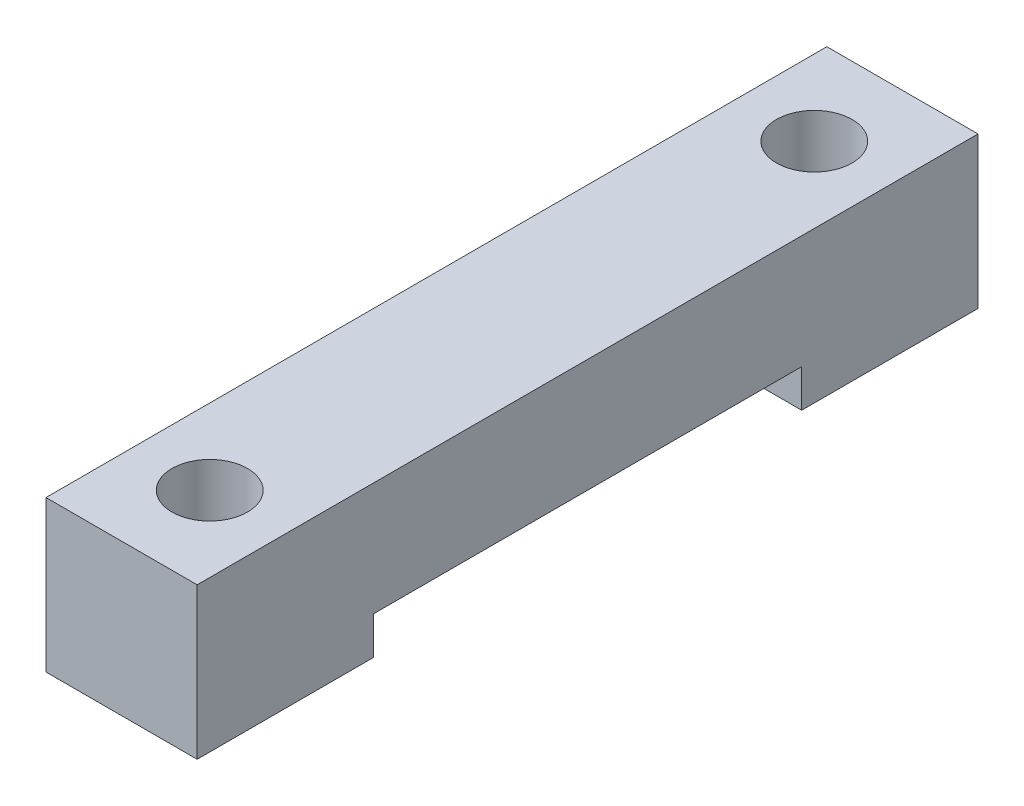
ISO-10303-21;
HEADER;
FILE_DESCRIPTION(('STEP AP214'),'2;1');
FILE_NAME('part.step','',(''),(''),'','','');
FILE_SCHEMA(('AUTOMOTIVE_DESIGN { 1 0 10303 214 1 1 1 1 }'));
ENDSEC;
DATA;
#1=APPLICATION_CONTEXT('core data for automotive mechanical design processes');
#2=APPLICATION_PROTOCOL_DEFINITION('international standard','automotive_design',2000,#1);
#3=PRODUCT_CONTEXT('',#1,'mechanical');
#4=PRODUCT('Part','Part','',(#3));
#5=PRODUCT_RELATED_PRODUCT_CATEGORY('part','',(#4));
#6=PRODUCT_DEFINITION_FORMATION('','',#4);
#7=PRODUCT_DEFINITION_CONTEXT('part definition',#1,'design');
#8=PRODUCT_DEFINITION('design','',#6,#7);
#9=PRODUCT_DEFINITION_SHAPE('','',#8);
#10=(LENGTH_UNIT() NAMED_UNIT(*) SI_UNIT(.MILLI.,.METRE.));
#11=(NAMED_UNIT(*) PLANE_ANGLE_UNIT() SI_UNIT($,.RADIAN.));
#12=(NAMED_UNIT(*) SI_UNIT($,.STERADIAN.) SOLID_ANGLE_UNIT());
#13=UNCERTAINTY_MEASURE_WITH_UNIT(LENGTH_MEASURE(1.E-05),#10,'distance_accuracy_value','');
#14=(GEOMETRIC_REPRESENTATION_CONTEXT(3) GLOBAL_UNCERTAINTY_ASSIGNED_CONTEXT((#13)) GLOBAL_UNIT_ASSIGNED_CONTEXT((#10,
#11,#12)) REPRESENTATION_CONTEXT('',''));
#15=CARTESIAN_POINT('',(0.,0.,0.));
#16=DIRECTION('',(0.,0.,1.));
#17=DIRECTION('',(1.,0.,0.));
#18=AXIS2_PLACEMENT_3D('',#15,#16,#17);
#19=CARTESIAN_POINT('',(0.,0.,-62.));
#20=DIRECTION('',(0.,-1.,0.));
#21=DIRECTION('',(0.,0.,-1.));
#22=AXIS2_PLACEMENT_3D('',#19,#20,#21);
#23=PLANE('',#22);
#24=DIRECTION('',(1.,0.,0.));
#25=VECTOR('',#24,1.);
#26=CARTESIAN_POINT('',(0.,0.,-14.));
#27=LINE('',#26,#25);
#28=CARTESIAN_POINT('',(0.,0.,-14.));
#29=VERTEX_POINT('',#28);
#30=CARTESIAN_POINT('',(12.,0.,-14.));
#31=VERTEX_POINT('',#30);
#32=EDGE_CURVE('E106',#29,#31,#27,.T.);
#33=ORIENTED_EDGE('',*,*,#32,.T.);
#34=DIRECTION('',(0.,0.,-1.));
#35=VECTOR('',#34,1.);
#36=CARTESIAN_POINT('',(12.,0.,0.));
#37=LINE('',#36,#35);
#38=CARTESIAN_POINT('',(12.,0.,0.));
#39=VERTEX_POINT('',#38);
#40=EDGE_CURVE('E142',#39,#31,#37,.T.);
#41=ORIENTED_EDGE('',*,*,#40,.F.);
#42=DIRECTION('',(1.,0.,0.));
#43=VECTOR('',#42,1.);
#44=CARTESIAN_POINT('',(0.,0.,0.));
#45=LINE('',#44,#43);
#46=CARTESIAN_POINT('',(0.,0.,0.));
#47=VERTEX_POINT('',#46);
#48=EDGE_CURVE('E129',#47,#39,#45,.T.);
#49=ORIENTED_EDGE('',*,*,#48,.F.);
#50=DIRECTION('',(0.,0.,1.));
#51=VECTOR('',#50,1.);
#52=CARTESIAN_POINT('',(0.,0.,0.));
#53=LINE('',#52,#51);
#54=EDGE_CURVE('E121',#29,#47,#53,.T.);
#55=ORIENTED_EDGE('',*,*,#54,.F.);
#56=EDGE_LOOP('',(#33,#41,#49,#55));
#57=FACE_BOUND('',#56,.T.);
#58=CARTESIAN_POINT('',(6.00000000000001,0.,-7.));
#59=DIRECTION('',(0.,1.,0.));
#60=DIRECTION('',(0.,0.,1.));
#61=AXIS2_PLACEMENT_3D('',#58,#59,#60);
#62=CIRCLE('',#61,3.);
#63=CARTESIAN_POINT('',(6.00000000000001,0.,-4.));
#64=VERTEX_POINT('',#63);
#65=EDGE_CURVE('E195',#64,#64,#62,.T.);
#66=ORIENTED_EDGE('',*,*,#65,.T.);
#67=EDGE_LOOP('',(#66));
#68=FACE_BOUND('',#67,.T.);
#69=ADVANCED_FACE('F31',(#57,#68),#23,.T.);
#70=CARTESIAN_POINT('',(0.,12.,-62.));
#71=DIRECTION('',(0.,-1.,0.));
#72=DIRECTION('',(0.,0.,-1.));
#73=AXIS2_PLACEMENT_3D('',#70,#71,#72);
#74=PLANE('',#73);
#75=CARTESIAN_POINT('',(6.,12.,-55.));
#76=DIRECTION('',(0.,1.,0.));
#77=DIRECTION('',(0.,0.,1.));
#78=AXIS2_PLACEMENT_3D('',#75,#76,#77);
#79=CIRCLE('',#78,3.);
#80=CARTESIAN_POINT('',(6.,12.,-52.));
#81=VERTEX_POINT('',#80);
#82=EDGE_CURVE('E131',#81,#81,#79,.T.);
#83=ORIENTED_EDGE('',*,*,#82,.F.);
#84=EDGE_LOOP('',(#83));
#85=FACE_BOUND('',#84,.T.);
#86=DIRECTION('',(0.,0.,1.));
#87=VECTOR('',#86,1.);
#88=CARTESIAN_POINT('',(0.,12.,0.));
#89=LINE('',#88,#87);
#90=CARTESIAN_POINT('',(0.,12.,-62.));
#91=VERTEX_POINT('',#90);
#92=CARTESIAN_POINT('',(0.,12.,0.));
#93=VERTEX_POINT('',#92);
#94=EDGE_CURVE('E145',#91,#93,#89,.T.);
#95=ORIENTED_EDGE('',*,*,#94,.T.);
#96=DIRECTION('',(1.,0.,0.));
#97=VECTOR('',#96,1.);
#98=CARTESIAN_POINT('',(0.,12.,0.));
#99=LINE('',#98,#97);
#100=CARTESIAN_POINT('',(12.,12.,0.));
#101=VERTEX_POINT('',#100);
#102=EDGE_CURVE('E83',#93,#101,#99,.T.);
#103=ORIENTED_EDGE('',*,*,#102,.T.);
#104=DIRECTION('',(0.,0.,-1.));
#105=VECTOR('',#104,1.);
#106=CARTESIAN_POINT('',(12.,12.,0.));
#107=LINE('',#106,#105);
#108=CARTESIAN_POINT('',(12.,12.,-62.));
#109=VERTEX_POINT('',#108);
#110=EDGE_CURVE('E154',#101,#109,#107,.T.);
#111=ORIENTED_EDGE('',*,*,#110,.T.);
#112=DIRECTION('',(-1.,0.,0.));
#113=VECTOR('',#112,1.);
#114=CARTESIAN_POINT('',(0.,12.,-62.));
#115=LINE('',#114,#113);
#116=EDGE_CURVE('E55',#109,#91,#115,.T.);
#117=ORIENTED_EDGE('',*,*,#116,.T.);
#118=EDGE_LOOP('',(#95,#103,#111,#117));
#119=FACE_BOUND('',#118,.T.);
#120=CARTESIAN_POINT('',(6.00000000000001,12.,-7.));
#121=DIRECTION('',(0.,1.,0.));
#122=DIRECTION('',(0.,0.,1.));
#123=AXIS2_PLACEMENT_3D('',#120,#121,#122);
#124=CIRCLE('',#123,3.);
#125=CARTESIAN_POINT('',(6.00000000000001,12.,-4.));
#126=VERTEX_POINT('',#125);
#127=EDGE_CURVE('E193',#126,#126,#124,.T.);
#128=ORIENTED_EDGE('',*,*,#127,.F.);
#129=EDGE_LOOP('',(#128));
#130=FACE_BOUND('',#129,.T.);
#131=ADVANCED_FACE('F161',(#85,#119,#130),#74,.F.);
#132=DIRECTION('',(1.,0.,0.));
#133=VECTOR('',#132,1.);
#134=CARTESIAN_POINT('',(0.,0.,-48.));
#135=LINE('',#134,#133);
#136=CARTESIAN_POINT('',(0.,0.,-48.));
#137=VERTEX_POINT('',#136);
#138=CARTESIAN_POINT('',(12.,0.,-48.));
#139=VERTEX_POINT('',#138);
#140=EDGE_CURVE('E46',#137,#139,#135,.T.);
#141=ORIENTED_EDGE('',*,*,#140,.F.);
#142=CARTESIAN_POINT('',(0.,0.,-62.));
#143=VERTEX_POINT('',#142);
#144=EDGE_CURVE('E130',#143,#137,#53,.T.);
#145=ORIENTED_EDGE('',*,*,#144,.F.);
#146=DIRECTION('',(-1.,0.,0.));
#147=VECTOR('',#146,1.);
#148=CARTESIAN_POINT('',(0.,0.,-62.));
#149=LINE('',#148,#147);
#150=CARTESIAN_POINT('',(12.,0.,-62.));
#151=VERTEX_POINT('',#150);
#152=EDGE_CURVE('E76',#151,#143,#149,.T.);
#153=ORIENTED_EDGE('',*,*,#152,.F.);
#154=EDGE_CURVE('E141',#139,#151,#37,.T.);
#155=ORIENTED_EDGE('',*,*,#154,.F.);
#156=EDGE_LOOP('',(#141,#145,#153,#155));
#157=FACE_BOUND('',#156,.T.);
#158=CARTESIAN_POINT('',(6.,0.,-55.));
#159=DIRECTION('',(0.,1.,0.));
#160=DIRECTION('',(0.,0.,1.));
#161=AXIS2_PLACEMENT_3D('',#158,#159,#160);
#162=CIRCLE('',#161,3.);
#163=CARTESIAN_POINT('',(6.,0.,-52.));
#164=VERTEX_POINT('',#163);
#165=EDGE_CURVE('E135',#164,#164,#162,.T.);
#166=ORIENTED_EDGE('',*,*,#165,.T.);
#167=EDGE_LOOP('',(#166));
#168=FACE_BOUND('',#167,.T.);
#169=ADVANCED_FACE('F178',(#157,#168),#23,.T.);
#170=CARTESIAN_POINT('',(0.,12.,0.));
#171=DIRECTION('',(1.,0.,0.));
#172=DIRECTION('',(0.,0.,-1.));
#173=AXIS2_PLACEMENT_3D('',#170,#171,#172);
#174=PLANE('',#173);
#175=DIRECTION('',(0.,0.,1.));
#176=VECTOR('',#175,1.);
#177=CARTESIAN_POINT('',(0.,3.,-14.));
#178=LINE('',#177,#176);
#179=CARTESIAN_POINT('',(0.,3.,-48.));
#180=VERTEX_POINT('',#179);
#181=CARTESIAN_POINT('',(0.,3.,-14.));
#182=VERTEX_POINT('',#181);
#183=EDGE_CURVE('E117',#180,#182,#178,.T.);
#184=ORIENTED_EDGE('',*,*,#183,.T.);
#185=DIRECTION('',(0.,-1.,0.));
#186=VECTOR('',#185,1.);
#187=CARTESIAN_POINT('',(0.,0.,-14.));
#188=LINE('',#187,#186);
#189=EDGE_CURVE('E109',#182,#29,#188,.T.);
#190=ORIENTED_EDGE('',*,*,#189,.T.);
#191=ORIENTED_EDGE('',*,*,#54,.T.);
#192=DIRECTION('',(0.,-1.,0.));
#193=VECTOR('',#192,1.);
#194=CARTESIAN_POINT('',(0.,12.,0.));
#195=LINE('',#194,#193);
#196=EDGE_CURVE('E11',#93,#47,#195,.T.);
#197=ORIENTED_EDGE('',*,*,#196,.F.);
#198=ORIENTED_EDGE('',*,*,#94,.F.);
#199=DIRECTION('',(0.,-1.,0.));
#200=VECTOR('',#199,1.);
#201=CARTESIAN_POINT('',(0.,12.,-62.));
#202=LINE('',#201,#200);
#203=EDGE_CURVE('E146',#91,#143,#202,.T.);
#204=ORIENTED_EDGE('',*,*,#203,.T.);
#205=ORIENTED_EDGE('',*,*,#144,.T.);
#206=DIRECTION('',(0.,1.,0.));
#207=VECTOR('',#206,1.);
#208=CARTESIAN_POINT('',(0.,0.,-48.));
#209=LINE('',#208,#207);
#210=EDGE_CURVE('E125',#137,#180,#209,.T.);
#211=ORIENTED_EDGE('',*,*,#210,.T.);
#212=EDGE_LOOP('',(#184,#190,#191,#197,#198,#204,#205,#211));
#213=FACE_BOUND('',#212,.T.);
#214=ADVANCED_FACE('F33',(#213),#174,.F.);
#215=CARTESIAN_POINT('',(0.,12.,0.));
#216=DIRECTION('',(0.,0.,-1.));
#217=DIRECTION('',(-1.,0.,0.));
#218=AXIS2_PLACEMENT_3D('',#215,#216,#217);
#219=PLANE('',#218);
#220=ORIENTED_EDGE('',*,*,#48,.T.);
#221=DIRECTION('',(0.,-1.,0.));
#222=VECTOR('',#221,1.);
#223=CARTESIAN_POINT('',(12.,12.,0.));
#224=LINE('',#223,#222);
#225=EDGE_CURVE('E39',#101,#39,#224,.T.);
#226=ORIENTED_EDGE('',*,*,#225,.F.);
#227=ORIENTED_EDGE('',*,*,#102,.F.);
#228=ORIENTED_EDGE('',*,*,#196,.T.);
#229=EDGE_LOOP('',(#220,#226,#227,#228));
#230=FACE_BOUND('',#229,.T.);
#231=ADVANCED_FACE('F155',(#230),#219,.F.);
#232=CARTESIAN_POINT('',(12.,12.,0.));
#233=DIRECTION('',(-1.,0.,0.));
#234=DIRECTION('',(0.,0.,1.));
#235=AXIS2_PLACEMENT_3D('',#232,#233,#234);
#236=PLANE('',#235);
#237=ORIENTED_EDGE('',*,*,#40,.T.);
#238=DIRECTION('',(0.,-1.,0.));
#239=VECTOR('',#238,1.);
#240=CARTESIAN_POINT('',(12.,0.,-14.));
#241=LINE('',#240,#239);
#242=CARTESIAN_POINT('',(12.,3.,-14.));
#243=VERTEX_POINT('',#242);
#244=EDGE_CURVE('E112',#243,#31,#241,.T.);
#245=ORIENTED_EDGE('',*,*,#244,.F.);
#246=DIRECTION('',(0.,0.,1.));
#247=VECTOR('',#246,1.);
#248=CARTESIAN_POINT('',(12.,3.,-14.));
#249=LINE('',#248,#247);
#250=CARTESIAN_POINT('',(12.,3.,-48.));
#251=VERTEX_POINT('',#250);
#252=EDGE_CURVE('E126',#251,#243,#249,.T.);
#253=ORIENTED_EDGE('',*,*,#252,.F.);
#254=DIRECTION('',(0.,1.,0.));
#255=VECTOR('',#254,1.);
#256=CARTESIAN_POINT('',(12.,0.,-48.));
#257=LINE('',#256,#255);
#258=EDGE_CURVE('E209',#139,#251,#257,.T.);
#259=ORIENTED_EDGE('',*,*,#258,.F.);
#260=ORIENTED_EDGE('',*,*,#154,.T.);
#261=DIRECTION('',(0.,-1.,0.));
#262=VECTOR('',#261,1.);
#263=CARTESIAN_POINT('',(12.,12.,-62.));
#264=LINE('',#263,#262);
#265=EDGE_CURVE('E148',#109,#151,#264,.T.);
#266=ORIENTED_EDGE('',*,*,#265,.F.);
#267=ORIENTED_EDGE('',*,*,#110,.F.);
#268=ORIENTED_EDGE('',*,*,#225,.T.);
#269=EDGE_LOOP('',(#237,#245,#253,#259,#260,#266,#267,#268));
#270=FACE_BOUND('',#269,.T.);
#271=ADVANCED_FACE('F152',(#270),#236,.F.);
#272=CARTESIAN_POINT('',(0.,12.,-62.));
#273=DIRECTION('',(0.,0.,1.));
#274=DIRECTION('',(1.,0.,0.));
#275=AXIS2_PLACEMENT_3D('',#272,#273,#274);
#276=PLANE('',#275);
#277=ORIENTED_EDGE('',*,*,#152,.T.);
#278=ORIENTED_EDGE('',*,*,#203,.F.);
#279=ORIENTED_EDGE('',*,*,#116,.F.);
#280=ORIENTED_EDGE('',*,*,#265,.T.);
#281=EDGE_LOOP('',(#277,#278,#279,#280));
#282=FACE_BOUND('',#281,.T.);
#283=ADVANCED_FACE('F164',(#282),#276,.F.);
#284=CARTESIAN_POINT('',(6.,12.,-55.));
#285=DIRECTION('',(0.,-1.,0.));
#286=DIRECTION('',(0.,0.,-1.));
#287=AXIS2_PLACEMENT_3D('',#284,#285,#286);
#288=CYLINDRICAL_SURFACE('',#287,3.);
#289=ORIENTED_EDGE('',*,*,#82,.T.);
#290=EDGE_LOOP('',(#289));
#291=FACE_BOUND('',#290,.T.);
#292=ORIENTED_EDGE('',*,*,#165,.F.);
#293=EDGE_LOOP('',(#292));
#294=FACE_BOUND('',#293,.T.);
#295=ADVANCED_FACE('F166',(#291,#294),#288,.F.);
#296=CARTESIAN_POINT('',(6.00000000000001,12.,-7.));
#297=DIRECTION('',(0.,-1.,0.));
#298=DIRECTION('',(0.,0.,-1.));
#299=AXIS2_PLACEMENT_3D('',#296,#297,#298);
#300=CYLINDRICAL_SURFACE('',#299,3.);
#301=ORIENTED_EDGE('',*,*,#127,.T.);
#302=EDGE_LOOP('',(#301));
#303=FACE_BOUND('',#302,.T.);
#304=ORIENTED_EDGE('',*,*,#65,.F.);
#305=EDGE_LOOP('',(#304));
#306=FACE_BOUND('',#305,.T.);
#307=ADVANCED_FACE('F172',(#303,#306),#300,.F.);
#308=CARTESIAN_POINT('',(0.,0.,-14.));
#309=DIRECTION('',(0.,0.,1.));
#310=DIRECTION('',(1.,0.,0.));
#311=AXIS2_PLACEMENT_3D('',#308,#309,#310);
#312=PLANE('',#311);
#313=ORIENTED_EDGE('',*,*,#244,.T.);
#314=ORIENTED_EDGE('',*,*,#32,.F.);
#315=ORIENTED_EDGE('',*,*,#189,.F.);
#316=DIRECTION('',(1.,0.,0.));
#317=VECTOR('',#316,1.);
#318=CARTESIAN_POINT('',(0.,3.,-14.));
#319=LINE('',#318,#317);
#320=EDGE_CURVE('E200',#182,#243,#319,.T.);
#321=ORIENTED_EDGE('',*,*,#320,.T.);
#322=EDGE_LOOP('',(#313,#314,#315,#321));
#323=FACE_BOUND('',#322,.T.);
#324=ADVANCED_FACE('F108',(#323),#312,.F.);
#325=CARTESIAN_POINT('',(0.,3.,-14.));
#326=DIRECTION('',(0.,1.,0.));
#327=DIRECTION('',(0.,0.,1.));
#328=AXIS2_PLACEMENT_3D('',#325,#326,#327);
#329=PLANE('',#328);
#330=ORIENTED_EDGE('',*,*,#252,.T.);
#331=ORIENTED_EDGE('',*,*,#320,.F.);
#332=ORIENTED_EDGE('',*,*,#183,.F.);
#333=DIRECTION('',(1.,0.,0.));
#334=VECTOR('',#333,1.);
#335=CARTESIAN_POINT('',(0.,3.,-48.));
#336=LINE('',#335,#334);
#337=EDGE_CURVE('E204',#180,#251,#336,.T.);
#338=ORIENTED_EDGE('',*,*,#337,.T.);
#339=EDGE_LOOP('',(#330,#331,#332,#338));
#340=FACE_BOUND('',#339,.T.);
#341=ADVANCED_FACE('F216',(#340),#329,.F.);
#342=CARTESIAN_POINT('',(0.,0.,-48.));
#343=DIRECTION('',(0.,0.,-1.));
#344=DIRECTION('',(-1.,0.,0.));
#345=AXIS2_PLACEMENT_3D('',#342,#343,#344);
#346=PLANE('',#345);
#347=ORIENTED_EDGE('',*,*,#258,.T.);
#348=ORIENTED_EDGE('',*,*,#337,.F.);
#349=ORIENTED_EDGE('',*,*,#210,.F.);
#350=ORIENTED_EDGE('',*,*,#140,.T.);
#351=EDGE_LOOP('',(#347,#348,#349,#350));
#352=FACE_BOUND('',#351,.T.);
#353=ADVANCED_FACE('F213',(#352),#346,.F.);
#354=CLOSED_SHELL('',(#69,#131,#169,#214,#231,#271,#283,#295,#307,#324,#341,#353));
#355=MANIFOLD_SOLID_BREP('B2',#354);
#356=ADVANCED_BREP_SHAPE_REPRESENTATION('',(#18,#355),#14);
#357=SHAPE_DEFINITION_REPRESENTATION(#9,#356);
ENDSEC;
END-ISO-10303-21;
